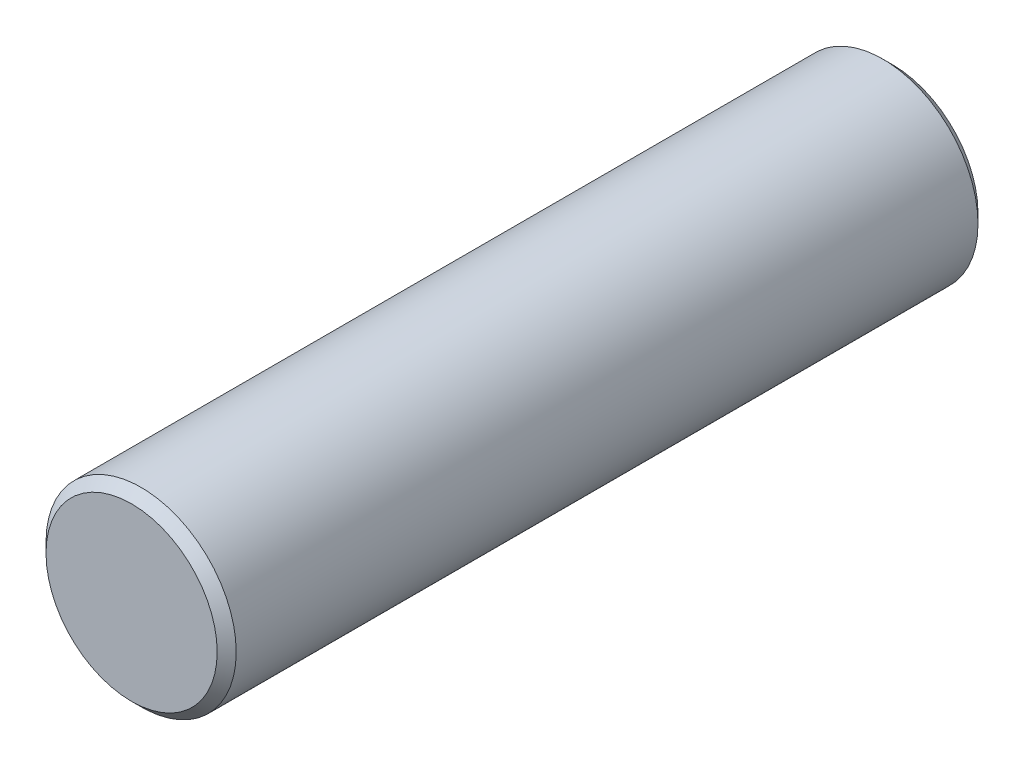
ISO-10303-21;
HEADER;
FILE_DESCRIPTION(('STEP AP214'),'2;1');
FILE_NAME('part.step','',(''),(''),'','','');
FILE_SCHEMA(('AUTOMOTIVE_DESIGN { 1 0 10303 214 1 1 1 1 }'));
ENDSEC;
DATA;
#1=APPLICATION_CONTEXT('core data for automotive mechanical design processes');
#2=APPLICATION_PROTOCOL_DEFINITION('international standard','automotive_design',2000,#1);
#3=PRODUCT_CONTEXT('',#1,'mechanical');
#4=PRODUCT('Part','Part','',(#3));
#5=PRODUCT_RELATED_PRODUCT_CATEGORY('part','',(#4));
#6=PRODUCT_DEFINITION_FORMATION('','',#4);
#7=PRODUCT_DEFINITION_CONTEXT('part definition',#1,'design');
#8=PRODUCT_DEFINITION('design','',#6,#7);
#9=PRODUCT_DEFINITION_SHAPE('','',#8);
#10=(LENGTH_UNIT() NAMED_UNIT(*) SI_UNIT(.MILLI.,.METRE.));
#11=(NAMED_UNIT(*) PLANE_ANGLE_UNIT() SI_UNIT($,.RADIAN.));
#12=(NAMED_UNIT(*) SI_UNIT($,.STERADIAN.) SOLID_ANGLE_UNIT());
#13=UNCERTAINTY_MEASURE_WITH_UNIT(LENGTH_MEASURE(1.E-05),#10,'distance_accuracy_value','');
#14=(GEOMETRIC_REPRESENTATION_CONTEXT(3) GLOBAL_UNCERTAINTY_ASSIGNED_CONTEXT((#13)) GLOBAL_UNIT_ASSIGNED_CONTEXT((#10,
#11,#12)) REPRESENTATION_CONTEXT('',''));
#15=CARTESIAN_POINT('',(0.,0.,0.));
#16=DIRECTION('',(0.,0.,1.));
#17=DIRECTION('',(1.,0.,0.));
#18=AXIS2_PLACEMENT_3D('',#15,#16,#17);
#19=CARTESIAN_POINT('',(0.,0.,40.));
#20=DIRECTION('',(0.,0.,-1.));
#21=DIRECTION('',(-1.,0.,0.));
#22=AXIS2_PLACEMENT_3D('',#19,#20,#21);
#23=CYLINDRICAL_SURFACE('',#22,5.);
#24=CARTESIAN_POINT('',(0.,0.,0.500000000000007));
#25=DIRECTION('',(0.,0.,1.));
#26=DIRECTION('',(1.,0.,0.));
#27=AXIS2_PLACEMENT_3D('',#24,#25,#26);
#28=CIRCLE('',#27,5.);
#29=CARTESIAN_POINT('',(5.,0.,0.500000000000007));
#30=VERTEX_POINT('',#29);
#31=EDGE_CURVE('E44',#30,#30,#28,.T.);
#32=ORIENTED_EDGE('',*,*,#31,.T.);
#33=EDGE_LOOP('',(#32));
#34=FACE_BOUND('',#33,.T.);
#35=CARTESIAN_POINT('',(0.,0.,39.5));
#36=DIRECTION('',(0.,0.,1.));
#37=DIRECTION('',(1.,0.,0.));
#38=AXIS2_PLACEMENT_3D('',#35,#36,#37);
#39=CIRCLE('',#38,5.);
#40=CARTESIAN_POINT('',(5.,0.,39.5));
#41=VERTEX_POINT('',#40);
#42=EDGE_CURVE('E48',#41,#41,#39,.F.);
#43=ORIENTED_EDGE('',*,*,#42,.T.);
#44=EDGE_LOOP('',(#43));
#45=FACE_BOUND('',#44,.T.);
#46=ADVANCED_FACE('F33',(#34,#45),#23,.T.);
#47=CARTESIAN_POINT('',(0.,0.,40.));
#48=DIRECTION('',(0.,0.,1.));
#49=DIRECTION('',(1.,0.,0.));
#50=AXIS2_PLACEMENT_3D('',#47,#48,#49);
#51=PLANE('',#50);
#52=CARTESIAN_POINT('',(0.,0.,40.));
#53=DIRECTION('',(0.,0.,1.));
#54=DIRECTION('',(1.,0.,0.));
#55=AXIS2_PLACEMENT_3D('',#52,#53,#54);
#56=CIRCLE('',#55,4.5);
#57=CARTESIAN_POINT('',(4.5,0.,40.));
#58=VERTEX_POINT('',#57);
#59=EDGE_CURVE('E10',#58,#58,#56,.T.);
#60=ORIENTED_EDGE('',*,*,#59,.T.);
#61=EDGE_LOOP('',(#60));
#62=FACE_BOUND('',#61,.T.);
#63=ADVANCED_FACE('F64',(#62),#51,.T.);
#64=CARTESIAN_POINT('',(0.,0.,0.));
#65=DIRECTION('',(0.,0.,1.));
#66=DIRECTION('',(1.,0.,0.));
#67=AXIS2_PLACEMENT_3D('',#64,#65,#66);
#68=PLANE('',#67);
#69=CARTESIAN_POINT('',(0.,0.,0.));
#70=DIRECTION('',(0.,0.,1.));
#71=DIRECTION('',(1.,0.,0.));
#72=AXIS2_PLACEMENT_3D('',#69,#70,#71);
#73=CIRCLE('',#72,4.49999999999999);
#74=CARTESIAN_POINT('',(4.49999999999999,0.,0.));
#75=VERTEX_POINT('',#74);
#76=EDGE_CURVE('E40',#75,#75,#73,.F.);
#77=ORIENTED_EDGE('',*,*,#76,.T.);
#78=EDGE_LOOP('',(#77));
#79=FACE_BOUND('',#78,.T.);
#80=ADVANCED_FACE('F61',(#79),#68,.F.);
#81=CARTESIAN_POINT('',(0.,0.,0.500000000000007));
#82=DIRECTION('',(0.,0.,1.));
#83=DIRECTION('',(1.,0.,0.));
#84=AXIS2_PLACEMENT_3D('',#81,#82,#83);
#85=CONICAL_SURFACE('',#84,5.,0.785398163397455);
#86=ORIENTED_EDGE('',*,*,#76,.F.);
#87=EDGE_LOOP('',(#86));
#88=FACE_BOUND('',#87,.T.);
#89=ORIENTED_EDGE('',*,*,#31,.F.);
#90=EDGE_LOOP('',(#89));
#91=FACE_BOUND('',#90,.T.);
#92=ADVANCED_FACE('F57',(#88,#91),#85,.T.);
#93=CARTESIAN_POINT('',(0.,0.,40.));
#94=DIRECTION('',(0.,0.,-1.));
#95=DIRECTION('',(-1.,0.,0.));
#96=AXIS2_PLACEMENT_3D('',#93,#94,#95);
#97=CONICAL_SURFACE('',#96,4.5,0.785398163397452);
#98=ORIENTED_EDGE('',*,*,#42,.F.);
#99=EDGE_LOOP('',(#98));
#100=FACE_BOUND('',#99,.T.);
#101=ORIENTED_EDGE('',*,*,#59,.F.);
#102=EDGE_LOOP('',(#101));
#103=FACE_BOUND('',#102,.T.);
#104=ADVANCED_FACE('F35',(#100,#103),#97,.T.);
#105=CLOSED_SHELL('',(#46,#63,#80,#92,#104));
#106=MANIFOLD_SOLID_BREP('B2',#105);
#107=ADVANCED_BREP_SHAPE_REPRESENTATION('',(#18,#106),#14);
#108=SHAPE_DEFINITION_REPRESENTATION(#9,#107);
ENDSEC;
END-ISO-10303-21;
